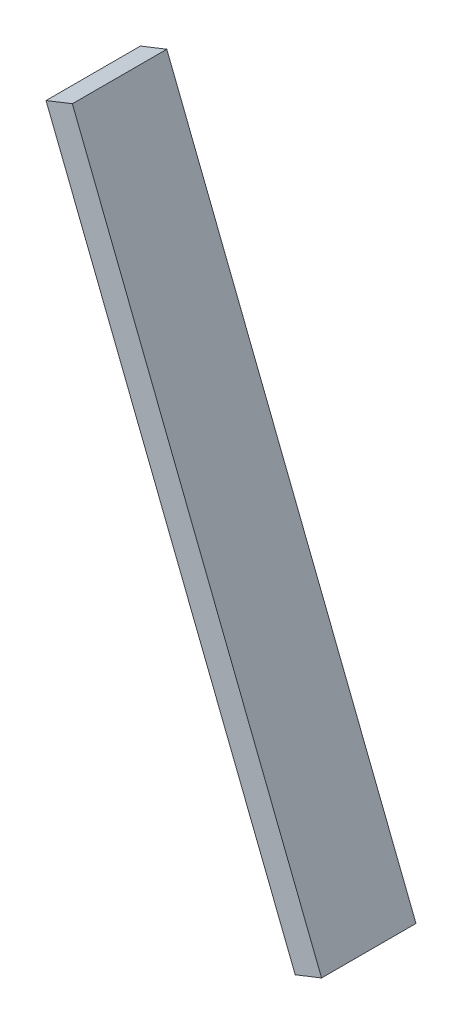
ISO-10303-21;
HEADER;
FILE_DESCRIPTION(('STEP AP214'),'2;1');
FILE_NAME('part.step','',(''),(''),'','','');
FILE_SCHEMA(('AUTOMOTIVE_DESIGN { 1 0 10303 214 1 1 1 1 }'));
ENDSEC;
DATA;
#1=APPLICATION_CONTEXT('core data for automotive mechanical design processes');
#2=APPLICATION_PROTOCOL_DEFINITION('international standard','automotive_design',2000,#1);
#3=PRODUCT_CONTEXT('',#1,'mechanical');
#4=PRODUCT('Part','Part','',(#3));
#5=PRODUCT_RELATED_PRODUCT_CATEGORY('part','',(#4));
#6=PRODUCT_DEFINITION_FORMATION('','',#4);
#7=PRODUCT_DEFINITION_CONTEXT('part definition',#1,'design');
#8=PRODUCT_DEFINITION('design','',#6,#7);
#9=PRODUCT_DEFINITION_SHAPE('','',#8);
#10=(LENGTH_UNIT() NAMED_UNIT(*) SI_UNIT(.MILLI.,.METRE.));
#11=(NAMED_UNIT(*) PLANE_ANGLE_UNIT() SI_UNIT($,.RADIAN.));
#12=(NAMED_UNIT(*) SI_UNIT($,.STERADIAN.) SOLID_ANGLE_UNIT());
#13=UNCERTAINTY_MEASURE_WITH_UNIT(LENGTH_MEASURE(1.E-05),#10,'distance_accuracy_value','');
#14=(GEOMETRIC_REPRESENTATION_CONTEXT(3) GLOBAL_UNCERTAINTY_ASSIGNED_CONTEXT((#13)) GLOBAL_UNIT_ASSIGNED_CONTEXT((#10,
#11,#12)) REPRESENTATION_CONTEXT('',''));
#15=CARTESIAN_POINT('',(0.,0.,0.));
#16=DIRECTION('',(0.,0.,1.));
#17=DIRECTION('',(1.,0.,0.));
#18=AXIS2_PLACEMENT_3D('',#15,#16,#17);
#19=CARTESIAN_POINT('',(0.,0.,5000.));
#20=DIRECTION('',(0.366501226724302,-0.930417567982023,0.));
#21=DIRECTION('',(0.930417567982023,0.366501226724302,0.));
#22=AXIS2_PLACEMENT_3D('',#19,#20,#21);
#23=PLANE('',#22);
#24=DIRECTION('',(-0.930417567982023,-0.366501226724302,0.));
#25=VECTOR('',#24,1.);
#26=CARTESIAN_POINT('',(0.,0.,-5000.));
#27=LINE('',#26,#25);
#28=CARTESIAN_POINT('',(0.,0.,-5000.));
#29=VERTEX_POINT('',#28);
#30=CARTESIAN_POINT('',(-2791.25270394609,-1099.50368017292,-5000.));
#31=VERTEX_POINT('',#30);
#32=EDGE_CURVE('E96',#29,#31,#27,.T.);
#33=ORIENTED_EDGE('',*,*,#32,.T.);
#34=DIRECTION('',(0.,0.,-1.));
#35=VECTOR('',#34,1.);
#36=CARTESIAN_POINT('',(-2791.25270394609,-1099.50368017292,5000.));
#37=LINE('',#36,#35);
#38=CARTESIAN_POINT('',(-2791.25270394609,-1099.50368017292,5000.));
#39=VERTEX_POINT('',#38);
#40=EDGE_CURVE('E11',#39,#31,#37,.T.);
#41=ORIENTED_EDGE('',*,*,#40,.F.);
#42=DIRECTION('',(-0.930417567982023,-0.366501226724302,0.));
#43=VECTOR('',#42,1.);
#44=CARTESIAN_POINT('',(0.,0.,5000.));
#45=LINE('',#44,#43);
#46=CARTESIAN_POINT('',(0.,0.,5000.));
#47=VERTEX_POINT('',#46);
#48=EDGE_CURVE('E84',#47,#39,#45,.T.);
#49=ORIENTED_EDGE('',*,*,#48,.F.);
#50=DIRECTION('',(0.,0.,-1.));
#51=VECTOR('',#50,1.);
#52=CARTESIAN_POINT('',(0.,0.,5000.));
#53=LINE('',#52,#51);
#54=EDGE_CURVE('E92',#47,#29,#53,.T.);
#55=ORIENTED_EDGE('',*,*,#54,.T.);
#56=EDGE_LOOP('',(#33,#41,#49,#55));
#57=FACE_BOUND('',#56,.T.);
#58=ADVANCED_FACE('F33',(#57),#23,.F.);
#59=CARTESIAN_POINT('',(-2791.25270394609,-1099.50368017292,5000.));
#60=DIRECTION('',(0.930417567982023,0.366501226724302,0.));
#61=DIRECTION('',(-0.366501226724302,0.930417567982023,0.));
#62=AXIS2_PLACEMENT_3D('',#59,#60,#61);
#63=PLANE('',#62);
#64=DIRECTION('',(0.366501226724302,-0.930417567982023,0.));
#65=VECTOR('',#64,1.);
#66=CARTESIAN_POINT('',(-2791.25270394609,-1099.50368017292,-5000.));
#67=LINE('',#66,#65);
#68=CARTESIAN_POINT('',(23600.7491622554,-68099.5036801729,-5000.));
#69=VERTEX_POINT('',#68);
#70=EDGE_CURVE('E88',#31,#69,#67,.T.);
#71=ORIENTED_EDGE('',*,*,#70,.T.);
#72=DIRECTION('',(0.,0.,-1.));
#73=VECTOR('',#72,1.);
#74=CARTESIAN_POINT('',(23600.7491622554,-68099.5036801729,5000.));
#75=LINE('',#74,#73);
#76=CARTESIAN_POINT('',(23600.7491622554,-68099.5036801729,5000.));
#77=VERTEX_POINT('',#76);
#78=EDGE_CURVE('E41',#77,#69,#75,.T.);
#79=ORIENTED_EDGE('',*,*,#78,.F.);
#80=DIRECTION('',(0.366501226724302,-0.930417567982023,0.));
#81=VECTOR('',#80,1.);
#82=CARTESIAN_POINT('',(-2791.25270394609,-1099.50368017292,5000.));
#83=LINE('',#82,#81);
#84=EDGE_CURVE('E79',#39,#77,#83,.T.);
#85=ORIENTED_EDGE('',*,*,#84,.F.);
#86=ORIENTED_EDGE('',*,*,#40,.T.);
#87=EDGE_LOOP('',(#71,#79,#85,#86));
#88=FACE_BOUND('',#87,.T.);
#89=ADVANCED_FACE('F87',(#88),#63,.F.);
#90=CARTESIAN_POINT('',(23600.7491622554,-68099.5036801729,5000.));
#91=DIRECTION('',(-0.366501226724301,0.930417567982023,0.));
#92=DIRECTION('',(-0.930417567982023,-0.366501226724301,0.));
#93=AXIS2_PLACEMENT_3D('',#90,#91,#92);
#94=PLANE('',#93);
#95=DIRECTION('',(0.930417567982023,0.366501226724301,0.));
#96=VECTOR('',#95,1.);
#97=CARTESIAN_POINT('',(23600.7491622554,-68099.5036801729,-5000.));
#98=LINE('',#97,#96);
#99=CARTESIAN_POINT('',(26392.0018662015,-67000.,-5000.));
#100=VERTEX_POINT('',#99);
#101=EDGE_CURVE('E66',#69,#100,#98,.T.);
#102=ORIENTED_EDGE('',*,*,#101,.T.);
#103=DIRECTION('',(0.,0.,-1.));
#104=VECTOR('',#103,1.);
#105=CARTESIAN_POINT('',(26392.0018662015,-67000.,5000.));
#106=LINE('',#105,#104);
#107=CARTESIAN_POINT('',(26392.0018662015,-67000.,5000.));
#108=VERTEX_POINT('',#107);
#109=EDGE_CURVE('E89',#108,#100,#106,.T.);
#110=ORIENTED_EDGE('',*,*,#109,.F.);
#111=DIRECTION('',(0.930417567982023,0.366501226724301,0.));
#112=VECTOR('',#111,1.);
#113=CARTESIAN_POINT('',(23600.7491622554,-68099.5036801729,5000.));
#114=LINE('',#113,#112);
#115=EDGE_CURVE('E82',#77,#108,#114,.T.);
#116=ORIENTED_EDGE('',*,*,#115,.F.);
#117=ORIENTED_EDGE('',*,*,#78,.T.);
#118=EDGE_LOOP('',(#102,#110,#116,#117));
#119=FACE_BOUND('',#118,.T.);
#120=ADVANCED_FACE('F90',(#119),#94,.F.);
#121=CARTESIAN_POINT('',(26392.0018662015,-67000.,5000.));
#122=DIRECTION('',(-0.930417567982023,-0.366501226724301,0.));
#123=DIRECTION('',(0.366501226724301,-0.930417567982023,0.));
#124=AXIS2_PLACEMENT_3D('',#121,#122,#123);
#125=PLANE('',#124);
#126=DIRECTION('',(-0.366501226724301,0.930417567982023,0.));
#127=VECTOR('',#126,1.);
#128=CARTESIAN_POINT('',(26392.0018662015,-67000.,-5000.));
#129=LINE('',#128,#127);
#130=EDGE_CURVE('E72',#100,#29,#129,.T.);
#131=ORIENTED_EDGE('',*,*,#130,.T.);
#132=ORIENTED_EDGE('',*,*,#54,.F.);
#133=DIRECTION('',(-0.366501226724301,0.930417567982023,0.));
#134=VECTOR('',#133,1.);
#135=CARTESIAN_POINT('',(26392.0018662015,-67000.,5000.));
#136=LINE('',#135,#134);
#137=EDGE_CURVE('E49',#108,#47,#136,.T.);
#138=ORIENTED_EDGE('',*,*,#137,.F.);
#139=ORIENTED_EDGE('',*,*,#109,.T.);
#140=EDGE_LOOP('',(#131,#132,#138,#139));
#141=FACE_BOUND('',#140,.T.);
#142=ADVANCED_FACE('F103',(#141),#125,.F.);
#143=CARTESIAN_POINT('',(0.,0.,5000.));
#144=DIRECTION('',(0.,0.,1.));
#145=DIRECTION('',(1.,0.,0.));
#146=AXIS2_PLACEMENT_3D('',#143,#144,#145);
#147=PLANE('',#146);
#148=ORIENTED_EDGE('',*,*,#48,.T.);
#149=ORIENTED_EDGE('',*,*,#84,.T.);
#150=ORIENTED_EDGE('',*,*,#115,.T.);
#151=ORIENTED_EDGE('',*,*,#137,.T.);
#152=EDGE_LOOP('',(#148,#149,#150,#151));
#153=FACE_BOUND('',#152,.T.);
#154=ADVANCED_FACE('F80',(#153),#147,.T.);
#155=CARTESIAN_POINT('',(0.,0.,-5000.));
#156=DIRECTION('',(0.,0.,1.));
#157=DIRECTION('',(1.,0.,0.));
#158=AXIS2_PLACEMENT_3D('',#155,#156,#157);
#159=PLANE('',#158);
#160=ORIENTED_EDGE('',*,*,#32,.F.);
#161=ORIENTED_EDGE('',*,*,#130,.F.);
#162=ORIENTED_EDGE('',*,*,#101,.F.);
#163=ORIENTED_EDGE('',*,*,#70,.F.);
#164=EDGE_LOOP('',(#160,#161,#162,#163));
#165=FACE_BOUND('',#164,.T.);
#166=ADVANCED_FACE('F106',(#165),#159,.F.);
#167=CLOSED_SHELL('',(#58,#89,#120,#142,#154,#166));
#168=MANIFOLD_SOLID_BREP('B2',#167);
#169=ADVANCED_BREP_SHAPE_REPRESENTATION('',(#18,#168),#14);
#170=SHAPE_DEFINITION_REPRESENTATION(#9,#169);
ENDSEC;
END-ISO-10303-21;
